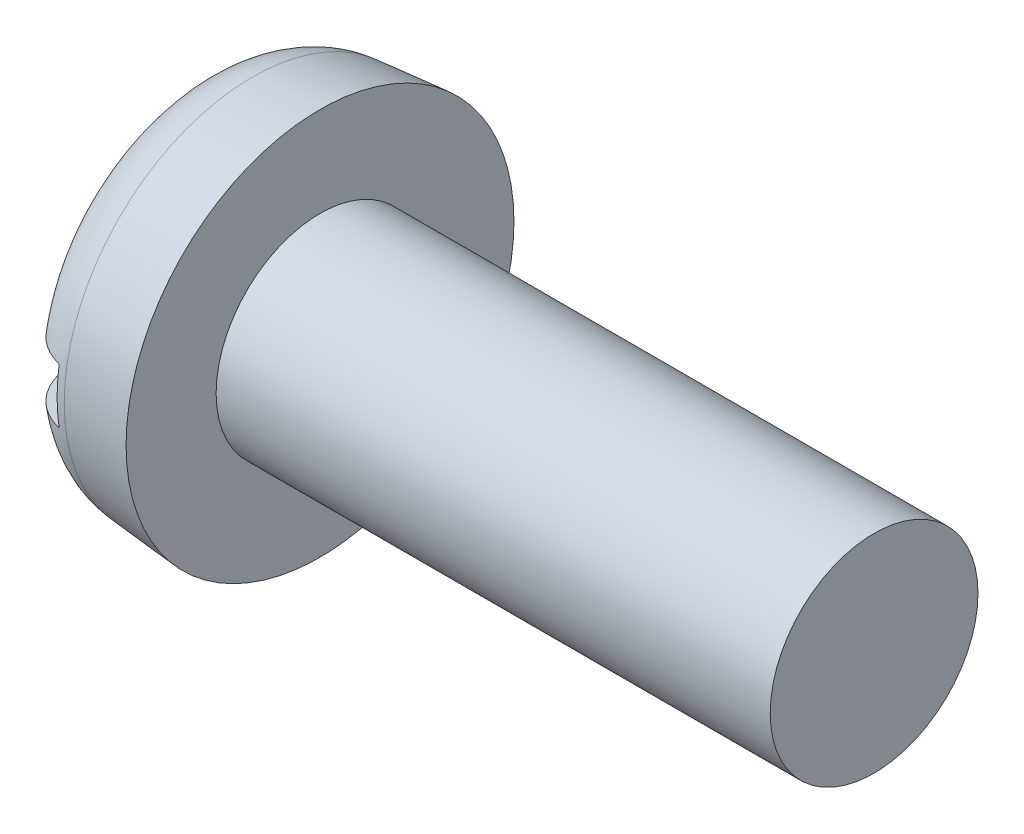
from build123d import *

# Parameters (mm, degrees)
FILLET2_R  = 0.9
SKETCH2_W  = 5.6
SKETCH2_H  = 0.8
SLOT_DEPTH = 0.7


with BuildPart() as part:
    # BodySke → Base-Revolve (revolve)
    with BuildSketch(Plane.XY, mode=Mode.PRIVATE) as base_revolve_sk:
        Polygon((1.8, 1.5), (1.8, 2.8), (0, 2.642520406), (0, 0), (9.8, 0), (9.8, 1.5), align=None)
    revolve(base_revolve_sk.sketch.rotate(Axis((-25.4, 0, 0), (1, 0, 0)), 90), axis=Axis((-25.4, 0, 0), (1, 0, 0)))

    # Fillet2
    fillet2_edges = [part.edges().sort_by_distance(p)[0] for p in [
        (0, 0, -2.642520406),
    ]]
    fillet(fillet2_edges, radius=FILLET2_R)

    # Sketch2 → Slot (cut)
    with BuildSketch(Plane(origin=(0, 0, 0), x_dir=(0, 0, -1), z_dir=(1, 0, 0))):
        Rectangle(SKETCH2_W, SKETCH2_H)
    extrude(amount=SLOT_DEPTH, mode=Mode.SUBTRACT)


solid = part.part
